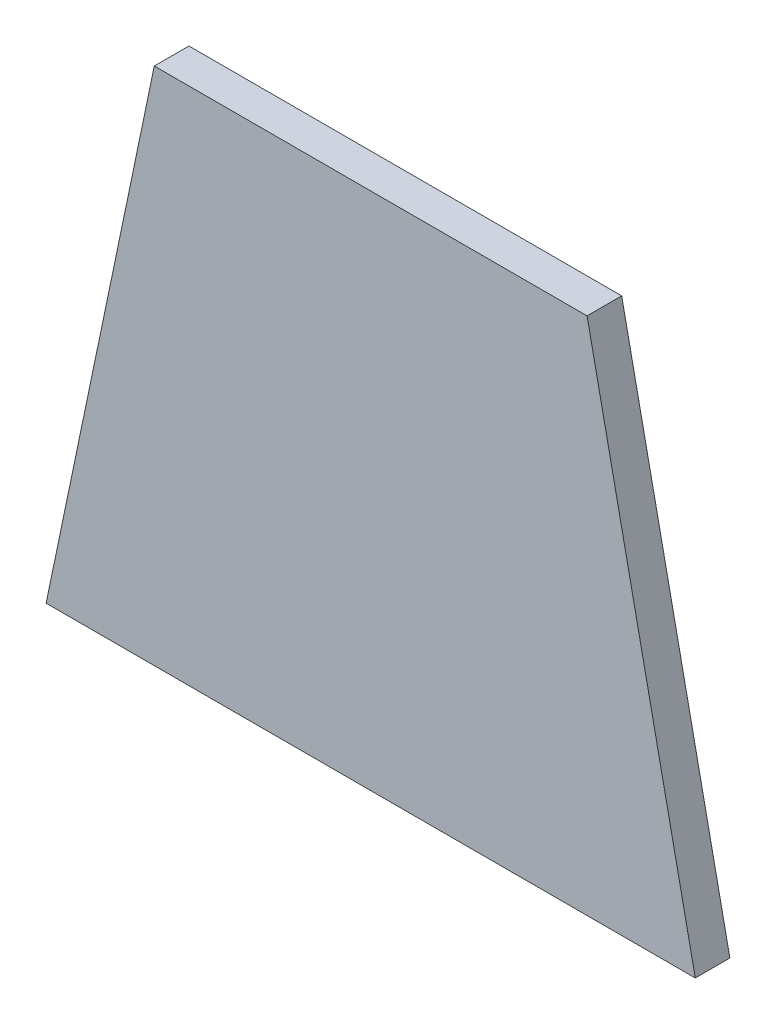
ISO-10303-21;
HEADER;
FILE_DESCRIPTION(('STEP AP214'),'2;1');
FILE_NAME('part.step','',(''),(''),'','','');
FILE_SCHEMA(('AUTOMOTIVE_DESIGN { 1 0 10303 214 1 1 1 1 }'));
ENDSEC;
DATA;
#1=APPLICATION_CONTEXT('core data for automotive mechanical design processes');
#2=APPLICATION_PROTOCOL_DEFINITION('international standard','automotive_design',2000,#1);
#3=PRODUCT_CONTEXT('',#1,'mechanical');
#4=PRODUCT('Part','Part','',(#3));
#5=PRODUCT_RELATED_PRODUCT_CATEGORY('part','',(#4));
#6=PRODUCT_DEFINITION_FORMATION('','',#4);
#7=PRODUCT_DEFINITION_CONTEXT('part definition',#1,'design');
#8=PRODUCT_DEFINITION('design','',#6,#7);
#9=PRODUCT_DEFINITION_SHAPE('','',#8);
#10=(LENGTH_UNIT() NAMED_UNIT(*) SI_UNIT(.MILLI.,.METRE.));
#11=(NAMED_UNIT(*) PLANE_ANGLE_UNIT() SI_UNIT($,.RADIAN.));
#12=(NAMED_UNIT(*) SI_UNIT($,.STERADIAN.) SOLID_ANGLE_UNIT());
#13=UNCERTAINTY_MEASURE_WITH_UNIT(LENGTH_MEASURE(1.E-05),#10,'distance_accuracy_value','');
#14=(GEOMETRIC_REPRESENTATION_CONTEXT(3) GLOBAL_UNCERTAINTY_ASSIGNED_CONTEXT((#13)) GLOBAL_UNIT_ASSIGNED_CONTEXT((#10,
#11,#12)) REPRESENTATION_CONTEXT('',''));
#15=CARTESIAN_POINT('',(0.,0.,0.));
#16=DIRECTION('',(0.,0.,1.));
#17=DIRECTION('',(1.,0.,0.));
#18=AXIS2_PLACEMENT_3D('',#15,#16,#17);
#19=CARTESIAN_POINT('',(150.,0.,8.));
#20=DIRECTION('',(0.,1.,0.));
#21=DIRECTION('',(-0.999999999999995,0.,0.));
#22=AXIS2_PLACEMENT_3D('',#19,#20,#21);
#23=PLANE('',#22);
#24=DIRECTION('',(0.999999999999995,0.,0.));
#25=VECTOR('',#24,1.);
#26=CARTESIAN_POINT('',(150.,0.,0.));
#27=LINE('',#26,#25);
#28=CARTESIAN_POINT('',(0.,0.,0.));
#29=VERTEX_POINT('',#28);
#30=CARTESIAN_POINT('',(150.,0.,0.));
#31=VERTEX_POINT('',#30);
#32=EDGE_CURVE('E73',#29,#31,#27,.T.);
#33=ORIENTED_EDGE('',*,*,#32,.T.);
#34=DIRECTION('',(0.,0.,-0.999999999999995));
#35=VECTOR('',#34,1.);
#36=CARTESIAN_POINT('',(150.,0.,8.));
#37=LINE('',#36,#35);
#38=CARTESIAN_POINT('',(150.,0.,8.));
#39=VERTEX_POINT('',#38);
#40=EDGE_CURVE('E11',#39,#31,#37,.T.);
#41=ORIENTED_EDGE('',*,*,#40,.F.);
#42=DIRECTION('',(0.999999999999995,0.,0.));
#43=VECTOR('',#42,1.);
#44=CARTESIAN_POINT('',(150.,0.,8.));
#45=LINE('',#44,#43);
#46=CARTESIAN_POINT('',(1.94289029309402E-13,0.,8.));
#47=VERTEX_POINT('',#46);
#48=EDGE_CURVE('E91',#47,#39,#45,.T.);
#49=ORIENTED_EDGE('',*,*,#48,.F.);
#50=DIRECTION('',(0.,0.,-0.999999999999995));
#51=VECTOR('',#50,1.);
#52=CARTESIAN_POINT('',(1.94289029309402E-13,0.,8.));
#53=LINE('',#52,#51);
#54=EDGE_CURVE('E85',#47,#29,#53,.T.);
#55=ORIENTED_EDGE('',*,*,#54,.T.);
#56=EDGE_LOOP('',(#33,#41,#49,#55));
#57=FACE_BOUND('',#56,.T.);
#58=ADVANCED_FACE('F29',(#57),#23,.F.);
#59=CARTESIAN_POINT('',(125.,120.,7.99999999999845));
#60=DIRECTION('',(-0.9789804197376,-0.203954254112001,0.));
#61=DIRECTION('',(0.203954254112,-0.978980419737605,0.));
#62=AXIS2_PLACEMENT_3D('',#59,#60,#61);
#63=PLANE('',#62);
#64=DIRECTION('',(-0.203954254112,0.978980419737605,0.));
#65=VECTOR('',#64,1.);
#66=CARTESIAN_POINT('',(125.,120.,-1.55431223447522E-12));
#67=LINE('',#66,#65);
#68=CARTESIAN_POINT('',(125.,120.,-1.55431223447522E-12));
#69=VERTEX_POINT('',#68);
#70=EDGE_CURVE('E69',#31,#69,#67,.T.);
#71=ORIENTED_EDGE('',*,*,#70,.T.);
#72=DIRECTION('',(0.,0.,-0.999999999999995));
#73=VECTOR('',#72,1.);
#74=CARTESIAN_POINT('',(125.,120.,7.99999999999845));
#75=LINE('',#74,#73);
#76=CARTESIAN_POINT('',(125.,120.,7.99999999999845));
#77=VERTEX_POINT('',#76);
#78=EDGE_CURVE('E36',#77,#69,#75,.T.);
#79=ORIENTED_EDGE('',*,*,#78,.F.);
#80=DIRECTION('',(-0.203954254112,0.978980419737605,0.));
#81=VECTOR('',#80,1.);
#82=CARTESIAN_POINT('',(125.,120.,7.99999999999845));
#83=LINE('',#82,#81);
#84=EDGE_CURVE('E81',#39,#77,#83,.T.);
#85=ORIENTED_EDGE('',*,*,#84,.F.);
#86=ORIENTED_EDGE('',*,*,#40,.T.);
#87=EDGE_LOOP('',(#71,#79,#85,#86));
#88=FACE_BOUND('',#87,.T.);
#89=ADVANCED_FACE('F80',(#88),#63,.F.);
#90=CARTESIAN_POINT('',(25.,119.999999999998,7.99999999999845));
#91=DIRECTION('',(0.,-1.,0.));
#92=DIRECTION('',(0.999999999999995,0.,0.));
#93=AXIS2_PLACEMENT_3D('',#90,#91,#92);
#94=PLANE('',#93);
#95=DIRECTION('',(-0.999999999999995,0.,0.));
#96=VECTOR('',#95,1.);
#97=CARTESIAN_POINT('',(25.,119.999999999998,-1.55431223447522E-12));
#98=LINE('',#97,#96);
#99=CARTESIAN_POINT('',(25.,119.999999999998,-1.55431223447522E-12));
#100=VERTEX_POINT('',#99);
#101=EDGE_CURVE('E74',#69,#100,#98,.T.);
#102=ORIENTED_EDGE('',*,*,#101,.T.);
#103=DIRECTION('',(0.,0.,-0.999999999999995));
#104=VECTOR('',#103,1.);
#105=CARTESIAN_POINT('',(25.,119.999999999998,7.99999999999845));
#106=LINE('',#105,#104);
#107=CARTESIAN_POINT('',(25.,119.999999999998,7.99999999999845));
#108=VERTEX_POINT('',#107);
#109=EDGE_CURVE('E97',#108,#100,#106,.T.);
#110=ORIENTED_EDGE('',*,*,#109,.F.);
#111=DIRECTION('',(-0.999999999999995,0.,0.));
#112=VECTOR('',#111,1.);
#113=CARTESIAN_POINT('',(25.,119.999999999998,7.99999999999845));
#114=LINE('',#113,#112);
#115=EDGE_CURVE('E48',#77,#108,#114,.T.);
#116=ORIENTED_EDGE('',*,*,#115,.F.);
#117=ORIENTED_EDGE('',*,*,#78,.T.);
#118=EDGE_LOOP('',(#102,#110,#116,#117));
#119=FACE_BOUND('',#118,.T.);
#120=ADVANCED_FACE('F100',(#119),#94,.F.);
#121=CARTESIAN_POINT('',(1.94289029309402E-13,0.,8.));
#122=DIRECTION('',(0.9789804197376,-0.203954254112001,0.));
#123=DIRECTION('',(0.203954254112,0.978980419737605,0.));
#124=AXIS2_PLACEMENT_3D('',#121,#122,#123);
#125=PLANE('',#124);
#126=DIRECTION('',(-0.203954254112,-0.978980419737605,0.));
#127=VECTOR('',#126,1.);
#128=CARTESIAN_POINT('',(0.,0.,0.));
#129=LINE('',#128,#127);
#130=EDGE_CURVE('E89',#100,#29,#129,.T.);
#131=ORIENTED_EDGE('',*,*,#130,.T.);
#132=ORIENTED_EDGE('',*,*,#54,.F.);
#133=DIRECTION('',(-0.203954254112,-0.978980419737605,0.));
#134=VECTOR('',#133,1.);
#135=CARTESIAN_POINT('',(1.94289029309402E-13,0.,8.));
#136=LINE('',#135,#134);
#137=EDGE_CURVE('E43',#108,#47,#136,.T.);
#138=ORIENTED_EDGE('',*,*,#137,.F.);
#139=ORIENTED_EDGE('',*,*,#109,.T.);
#140=EDGE_LOOP('',(#131,#132,#138,#139));
#141=FACE_BOUND('',#140,.T.);
#142=ADVANCED_FACE('F102',(#141),#125,.F.);
#143=CARTESIAN_POINT('',(1.94289029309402E-13,0.,8.));
#144=DIRECTION('',(0.,0.,-0.999999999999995));
#145=DIRECTION('',(-0.999999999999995,0.,0.));
#146=AXIS2_PLACEMENT_3D('',#143,#144,#145);
#147=PLANE('',#146);
#148=ORIENTED_EDGE('',*,*,#48,.T.);
#149=ORIENTED_EDGE('',*,*,#84,.T.);
#150=ORIENTED_EDGE('',*,*,#115,.T.);
#151=ORIENTED_EDGE('',*,*,#137,.T.);
#152=EDGE_LOOP('',(#148,#149,#150,#151));
#153=FACE_BOUND('',#152,.T.);
#154=ADVANCED_FACE('F103',(#153),#147,.F.);
#155=CARTESIAN_POINT('',(0.,0.,0.));
#156=DIRECTION('',(0.,0.,-0.999999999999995));
#157=DIRECTION('',(-0.999999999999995,0.,0.));
#158=AXIS2_PLACEMENT_3D('',#155,#156,#157);
#159=PLANE('',#158);
#160=ORIENTED_EDGE('',*,*,#32,.F.);
#161=ORIENTED_EDGE('',*,*,#130,.F.);
#162=ORIENTED_EDGE('',*,*,#101,.F.);
#163=ORIENTED_EDGE('',*,*,#70,.F.);
#164=EDGE_LOOP('',(#160,#161,#162,#163));
#165=FACE_BOUND('',#164,.T.);
#166=ADVANCED_FACE('F70',(#165),#159,.T.);
#167=CLOSED_SHELL('',(#58,#89,#120,#142,#154,#166));
#168=MANIFOLD_SOLID_BREP('B2',#167);
#169=ADVANCED_BREP_SHAPE_REPRESENTATION('',(#18,#168),#14);
#170=SHAPE_DEFINITION_REPRESENTATION(#9,#169);
ENDSEC;
END-ISO-10303-21;
